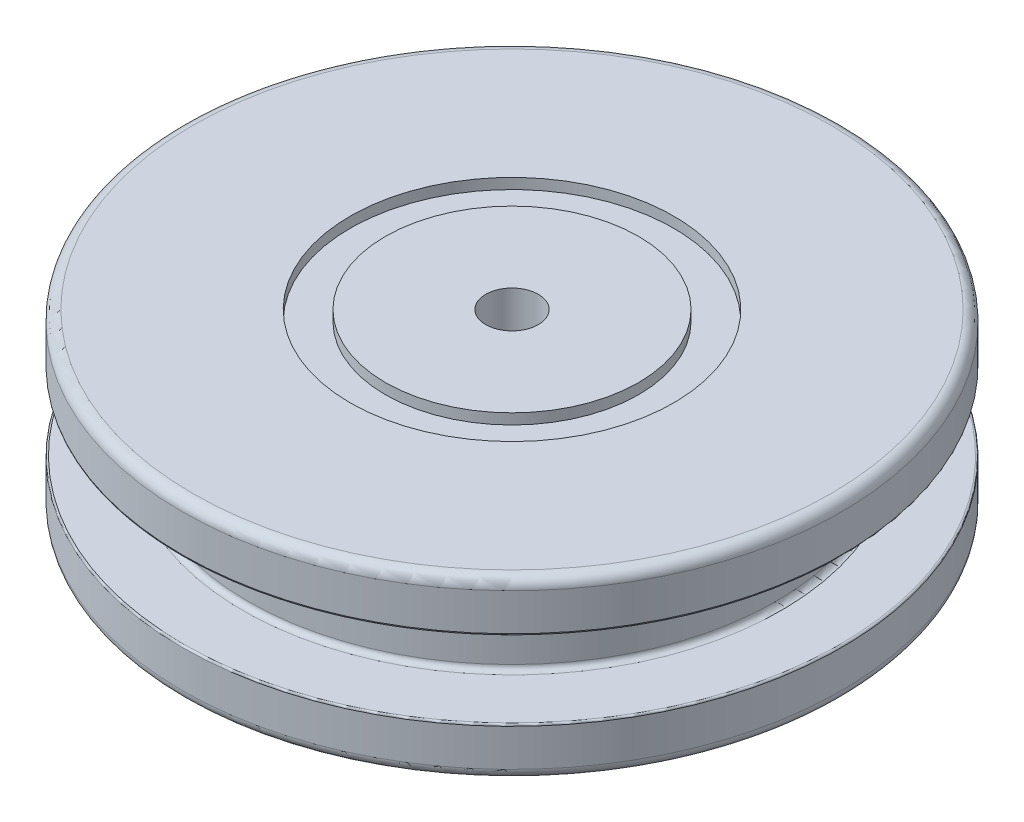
from build123d import *

# Parameters (mm, degrees)
SKETCH2_R                 = 3.175
SCREW_HOLE_DEPTH          = 7.62
SKETCH3_R                 = 11.684
SKETCH3_R_2               = 9.144
SPRING_GROOVE_DEPTH       = 0.762
F_6_CLEARANCE_HOLE1_D     = 3.7973
F_6_CLEARANCE_HOLE1_DEPTH = 14.478
F_6_CLEARANCE_HOLE1_TIP   = 1.140824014
BREAK_EDGE_R              = 0.127


with BuildPart() as part:
    # Sketch1 → Revolve1 (revolve)
    with BuildSketch(Plane.XY, mode=Mode.PRIVATE) as revolve1_sk:
        with BuildLine():
            Line((-20.6248, 0), (-23.0378, 0))
            ThreePointArc((-23.0378, 0), (-23.576615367, 0.223184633), (-23.7998, 0.762))
            Line((-23.7998, 0.762), (-23.7998, 11.938))
            ThreePointArc((-23.7998, 11.938), (-23.576615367, 12.476815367), (-23.0378, 12.7))
            Line((-23.0378, 12.7), (0, 12.7))
            Line((0, 12.7), (0, 0))
            Line((0, 0), (-5.08, 0))
            Line((-5.08, 0), (-5.543810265, 5.301375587))
            ThreePointArc((-5.543810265, 5.301375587), (-6.358145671, 6.952684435), (-8.074144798, 7.62))
            Line((-8.074144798, 7.62), (-11.952697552, 7.62))
            ThreePointArc((-11.952697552, 7.62), (-12.92471347, 7.426654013), (-13.748748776, 6.876051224))
            Line((-13.748748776, 6.876051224), (-20.6248, 0))
        make_face()
    revolve(revolve1_sk.sketch.rotate(Axis((0, 0, 0), (0, 1, 0)), 270), axis=Axis((0, 0, 0), (0, 1, 0)))

    # Sketch2 → screw hole (cut)
    with BuildSketch(Plane(origin=(0, 0, 0), x_dir=(1, 0, 0), z_dir=(0, 1, 0))):
        with Locations(Location((0, 0, 0), (0, 0, 90))):
            Circle(SKETCH2_R)
    extrude(amount=SCREW_HOLE_DEPTH, mode=Mode.SUBTRACT)

    # Sketch3 → spring groove (cut)
    with BuildSketch(Plane(origin=(0, 12.7, 0), x_dir=(1, 0, 0), z_dir=(0, 1, 0))):
        with Locations(Location((0, 0, 0), (0, 0, 270))):
            Circle(SKETCH3_R)
        with Locations(Location((0, 0, 0), (0, 0, 270))):
            Circle(SKETCH3_R_2, mode=Mode.SUBTRACT)
    extrude(amount=-SPRING_GROOVE_DEPTH, mode=Mode.SUBTRACT)

    # Sketch5 → cupseal (revolve, cut)
    with BuildSketch(Plane.XY, mode=Mode.PRIVATE) as cupseal_sk:
        with BuildLine():
            Line((-23.7998, 9.1186), (-19.431, 9.1186))
            ThreePointArc((-19.431, 9.1186), (-19.161592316, 9.007007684), (-19.05, 8.7376))
            Line((-19.05, 8.7376), (-19.05, 3.9624))
            ThreePointArc((-19.05, 3.9624), (-19.161592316, 3.692992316), (-19.431, 3.5814))
            Line((-19.431, 3.5814), (-23.7998, 3.5814))
            Line((-23.7998, 3.5814), (-23.7998, 9.1186))
        make_face()
    revolve(cupseal_sk.sketch.rotate(Axis((0, 0, 0), (0, 1, 0)), 270), axis=Axis((0, 0, 0), (0, 1, 0)), mode=Mode.SUBTRACT)

    # 6 Clearance Hole1
    with Locations(Plane(origin=(0, 12.7, 0), x_dir=(1, 0, 0), z_dir=(0, 1, 0))):
        with Locations((0, 0)):
            Hole(F_6_CLEARANCE_HOLE1_D / 2, depth=F_6_CLEARANCE_HOLE1_DEPTH)
            with Locations((0, 0, -(F_6_CLEARANCE_HOLE1_DEPTH + F_6_CLEARANCE_HOLE1_TIP / 2))):  # 118° drill point
                Cone(0, F_6_CLEARANCE_HOLE1_D / 2, F_6_CLEARANCE_HOLE1_TIP, mode=Mode.SUBTRACT)

    # break_edge
    break_edge_edges = [part.edges().sort_by_distance(p)[0] for p in [
        (0, 9.1186, 23.7998),
        (0, 3.5814, 23.7998),
    ]]
    fillet(break_edge_edges, radius=BREAK_EDGE_R)


solid = part.part
